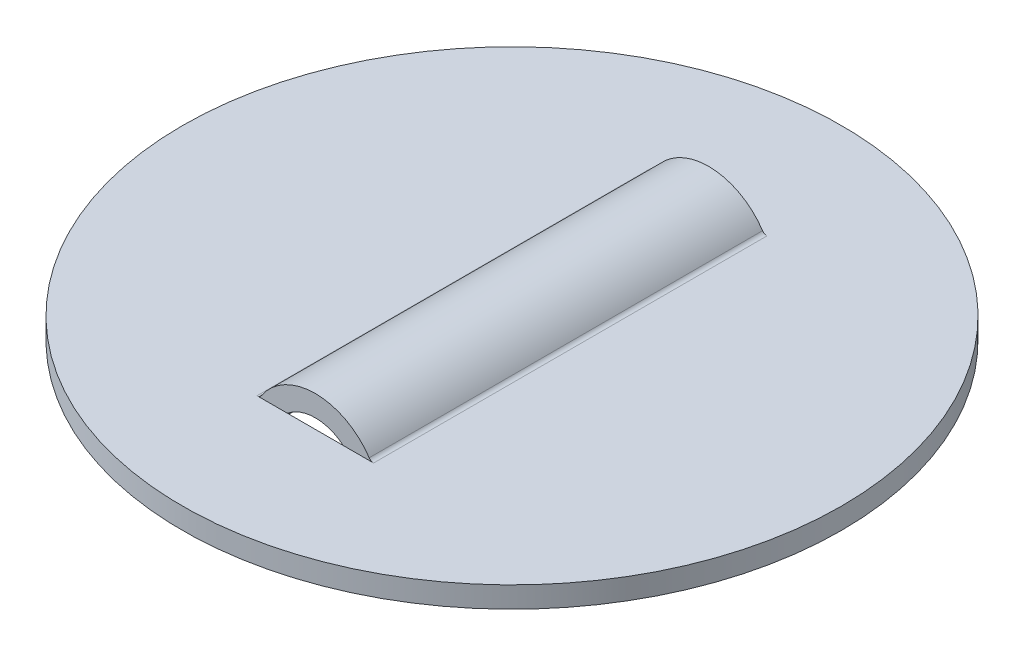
ISO-10303-21;
HEADER;
FILE_DESCRIPTION(('STEP AP214'),'2;1');
FILE_NAME('part.step','',(''),(''),'','','');
FILE_SCHEMA(('AUTOMOTIVE_DESIGN { 1 0 10303 214 1 1 1 1 }'));
ENDSEC;
DATA;
#1=APPLICATION_CONTEXT('core data for automotive mechanical design processes');
#2=APPLICATION_PROTOCOL_DEFINITION('international standard','automotive_design',2000,#1);
#3=PRODUCT_CONTEXT('',#1,'mechanical');
#4=PRODUCT('Part','Part','',(#3));
#5=PRODUCT_RELATED_PRODUCT_CATEGORY('part','',(#4));
#6=PRODUCT_DEFINITION_FORMATION('','',#4);
#7=PRODUCT_DEFINITION_CONTEXT('part definition',#1,'design');
#8=PRODUCT_DEFINITION('design','',#6,#7);
#9=PRODUCT_DEFINITION_SHAPE('','',#8);
#10=(LENGTH_UNIT() NAMED_UNIT(*) SI_UNIT(.MILLI.,.METRE.));
#11=(NAMED_UNIT(*) PLANE_ANGLE_UNIT() SI_UNIT($,.RADIAN.));
#12=(NAMED_UNIT(*) SI_UNIT($,.STERADIAN.) SOLID_ANGLE_UNIT());
#13=UNCERTAINTY_MEASURE_WITH_UNIT(LENGTH_MEASURE(1.E-05),#10,'distance_accuracy_value','');
#14=(GEOMETRIC_REPRESENTATION_CONTEXT(3) GLOBAL_UNCERTAINTY_ASSIGNED_CONTEXT((#13)) GLOBAL_UNIT_ASSIGNED_CONTEXT((#10,
#11,#12)) REPRESENTATION_CONTEXT('',''));
#15=CARTESIAN_POINT('',(0.,0.,0.));
#16=DIRECTION('',(0.,0.,1.));
#17=DIRECTION('',(1.,0.,0.));
#18=AXIS2_PLACEMENT_3D('',#15,#16,#17);
#19=CARTESIAN_POINT('',(0.,-1.6256,18.9484));
#20=DIRECTION('',(0.,0.,-1.));
#21=DIRECTION('',(-1.,0.,0.));
#22=AXIS2_PLACEMENT_3D('',#19,#20,#21);
#23=CYLINDRICAL_SURFACE('',#22,3.1242);
#24=CARTESIAN_POINT('',(0.,-1.6256,0.));
#25=DIRECTION('',(0.,0.,-1.));
#26=DIRECTION('',(-1.,0.,0.));
#27=AXIS2_PLACEMENT_3D('',#24,#25,#26);
#28=CIRCLE('',#27,3.1242);
#29=CARTESIAN_POINT('',(-2.59596220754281,0.112676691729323,0.));
#30=VERTEX_POINT('',#29);
#31=CARTESIAN_POINT('',(2.59596220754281,0.112676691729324,0.));
#32=VERTEX_POINT('',#31);
#33=EDGE_CURVE('E154',#30,#32,#28,.T.);
#34=ORIENTED_EDGE('',*,*,#33,.F.);
#35=DIRECTION('',(0.,0.,-1.));
#36=VECTOR('',#35,1.);
#37=CARTESIAN_POINT('',(-2.59596220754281,0.112676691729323,18.9484));
#38=LINE('',#37,#36);
#39=CARTESIAN_POINT('',(-2.59596220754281,0.112676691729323,18.9484));
#40=VERTEX_POINT('',#39);
#41=EDGE_CURVE('E92',#30,#40,#38,.F.);
#42=ORIENTED_EDGE('',*,*,#41,.T.);
#43=CARTESIAN_POINT('',(0.,-1.6256,18.9484));
#44=DIRECTION('',(0.,0.,-1.));
#45=DIRECTION('',(-1.,0.,0.));
#46=AXIS2_PLACEMENT_3D('',#43,#44,#45);
#47=CIRCLE('',#46,3.1242);
#48=CARTESIAN_POINT('',(2.59596220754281,0.112676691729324,18.9484));
#49=VERTEX_POINT('',#48);
#50=EDGE_CURVE('E164',#40,#49,#47,.T.);
#51=ORIENTED_EDGE('',*,*,#50,.T.);
#52=DIRECTION('',(0.,0.,-1.));
#53=VECTOR('',#52,1.);
#54=CARTESIAN_POINT('',(2.59596220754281,0.112676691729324,18.9484));
#55=LINE('',#54,#53);
#56=EDGE_CURVE('E137',#49,#32,#55,.T.);
#57=ORIENTED_EDGE('',*,*,#56,.T.);
#58=EDGE_LOOP('',(#34,#42,#51,#57));
#59=FACE_BOUND('',#58,.T.);
#60=ADVANCED_FACE('F18',(#59),#23,.T.);
#61=CARTESIAN_POINT('',(-2.80701604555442,0.254,0.));
#62=DIRECTION('',(0.,0.,1.));
#63=DIRECTION('',(1.,0.,0.));
#64=AXIS2_PLACEMENT_3D('',#61,#62,#63);
#65=CYLINDRICAL_SURFACE('',#64,1.27);
#66=CARTESIAN_POINT('',(-2.80701604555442,0.254,0.));
#67=DIRECTION('',(0.,0.,1.));
#68=DIRECTION('',(1.,0.,0.));
#69=AXIS2_PLACEMENT_3D('',#66,#67,#68);
#70=CIRCLE('',#69,1.27);
#71=CARTESIAN_POINT('',(-1.75174685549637,-0.452616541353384,0.));
#72=VERTEX_POINT('',#71);
#73=CARTESIAN_POINT('',(-2.80701604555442,-1.016,0.));
#74=VERTEX_POINT('',#73);
#75=EDGE_CURVE('E148',#72,#74,#70,.F.);
#76=ORIENTED_EDGE('',*,*,#75,.F.);
#77=DIRECTION('',(0.,0.,-1.));
#78=VECTOR('',#77,1.);
#79=CARTESIAN_POINT('',(-1.75174685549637,-0.452616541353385,18.9484));
#80=LINE('',#79,#78);
#81=CARTESIAN_POINT('',(-1.75174685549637,-0.452616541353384,18.9484));
#82=VERTEX_POINT('',#81);
#83=EDGE_CURVE('E128',#72,#82,#80,.F.);
#84=ORIENTED_EDGE('',*,*,#83,.T.);
#85=CARTESIAN_POINT('',(-2.80701604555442,0.254,18.9484));
#86=DIRECTION('',(0.,0.,1.));
#87=DIRECTION('',(1.,0.,0.));
#88=AXIS2_PLACEMENT_3D('',#85,#86,#87);
#89=CIRCLE('',#88,1.27);
#90=CARTESIAN_POINT('',(-2.80701604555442,-1.016,18.9484));
#91=VERTEX_POINT('',#90);
#92=EDGE_CURVE('E89',#82,#91,#89,.F.);
#93=ORIENTED_EDGE('',*,*,#92,.T.);
#94=DIRECTION('',(0.,0.,1.));
#95=VECTOR('',#94,1.);
#96=CARTESIAN_POINT('',(-2.80701604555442,-1.016,18.9484));
#97=LINE('',#96,#95);
#98=EDGE_CURVE('E131',#91,#74,#97,.F.);
#99=ORIENTED_EDGE('',*,*,#98,.T.);
#100=EDGE_LOOP('',(#76,#84,#93,#99));
#101=FACE_BOUND('',#100,.T.);
#102=ADVANCED_FACE('F215',(#101),#65,.T.);
#103=CARTESIAN_POINT('',(-15.875,-1.016,18.9484));
#104=DIRECTION('',(0.,1.,0.));
#105=DIRECTION('',(0.,0.,1.));
#106=AXIS2_PLACEMENT_3D('',#103,#104,#105);
#107=PLANE('',#106);
#108=ORIENTED_EDGE('',*,*,#98,.F.);
#109=DIRECTION('',(1.,0.,0.));
#110=VECTOR('',#109,1.);
#111=CARTESIAN_POINT('',(-2.80701604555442,-1.016,18.9484));
#112=LINE('',#111,#110);
#113=CARTESIAN_POINT('',(2.80701604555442,-1.016,18.9484));
#114=VERTEX_POINT('',#113);
#115=EDGE_CURVE('E123',#91,#114,#112,.T.);
#116=ORIENTED_EDGE('',*,*,#115,.T.);
#117=DIRECTION('',(0.,0.,1.));
#118=VECTOR('',#117,1.);
#119=CARTESIAN_POINT('',(2.80701604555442,-1.016,0.));
#120=LINE('',#119,#118);
#121=CARTESIAN_POINT('',(2.80701604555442,-1.016,0.));
#122=VERTEX_POINT('',#121);
#123=EDGE_CURVE('E129',#122,#114,#120,.T.);
#124=ORIENTED_EDGE('',*,*,#123,.F.);
#125=DIRECTION('',(1.,0.,0.));
#126=VECTOR('',#125,1.);
#127=CARTESIAN_POINT('',(-2.80701604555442,-1.016,0.));
#128=LINE('',#127,#126);
#129=EDGE_CURVE('E147',#74,#122,#128,.T.);
#130=ORIENTED_EDGE('',*,*,#129,.F.);
#131=EDGE_LOOP('',(#108,#116,#124,#130));
#132=FACE_BOUND('',#131,.T.);
#133=CARTESIAN_POINT('',(0.,-1.016,9.4742));
#134=DIRECTION('',(0.,-1.,0.));
#135=DIRECTION('',(1.,0.,0.));
#136=AXIS2_PLACEMENT_3D('',#133,#134,#135);
#137=CIRCLE('',#136,15.875);
#138=CARTESIAN_POINT('',(15.875,-1.016,9.4742));
#139=VERTEX_POINT('',#138);
#140=EDGE_CURVE('E21',#139,#139,#137,.F.);
#141=ORIENTED_EDGE('',*,*,#140,.F.);
#142=EDGE_LOOP('',(#141));
#143=FACE_BOUND('',#142,.T.);
#144=ADVANCED_FACE('F175',(#132,#143),#107,.F.);
#145=CARTESIAN_POINT('',(2.80701604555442,0.254000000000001,0.));
#146=DIRECTION('',(0.,0.,1.));
#147=DIRECTION('',(1.,0.,0.));
#148=AXIS2_PLACEMENT_3D('',#145,#146,#147);
#149=CYLINDRICAL_SURFACE('',#148,1.27);
#150=CARTESIAN_POINT('',(2.80701604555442,0.254000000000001,0.));
#151=DIRECTION('',(0.,0.,1.));
#152=DIRECTION('',(1.,0.,0.));
#153=AXIS2_PLACEMENT_3D('',#150,#151,#152);
#154=CIRCLE('',#153,1.27);
#155=CARTESIAN_POINT('',(1.75174685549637,-0.452616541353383,0.));
#156=VERTEX_POINT('',#155);
#157=EDGE_CURVE('E145',#122,#156,#154,.F.);
#158=ORIENTED_EDGE('',*,*,#157,.F.);
#159=ORIENTED_EDGE('',*,*,#123,.T.);
#160=CARTESIAN_POINT('',(2.80701604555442,0.254000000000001,18.9484));
#161=DIRECTION('',(0.,0.,1.));
#162=DIRECTION('',(1.,0.,0.));
#163=AXIS2_PLACEMENT_3D('',#160,#161,#162);
#164=CIRCLE('',#163,1.27);
#165=CARTESIAN_POINT('',(1.75174685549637,-0.452616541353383,18.9484));
#166=VERTEX_POINT('',#165);
#167=EDGE_CURVE('E168',#114,#166,#164,.F.);
#168=ORIENTED_EDGE('',*,*,#167,.T.);
#169=DIRECTION('',(0.,0.,-1.));
#170=VECTOR('',#169,1.);
#171=CARTESIAN_POINT('',(1.75174685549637,-0.452616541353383,18.9484));
#172=LINE('',#171,#170);
#173=EDGE_CURVE('E125',#166,#156,#172,.T.);
#174=ORIENTED_EDGE('',*,*,#173,.T.);
#175=EDGE_LOOP('',(#158,#159,#168,#174));
#176=FACE_BOUND('',#175,.T.);
#177=ADVANCED_FACE('F181',(#176),#149,.T.);
#178=CARTESIAN_POINT('',(0.,-1.6256,18.9484));
#179=DIRECTION('',(0.,0.,-1.));
#180=DIRECTION('',(-1.,0.,0.));
#181=AXIS2_PLACEMENT_3D('',#178,#179,#180);
#182=CYLINDRICAL_SURFACE('',#181,2.1082);
#183=CARTESIAN_POINT('',(0.,-1.6256,18.9484));
#184=DIRECTION('',(0.,0.,-1.));
#185=DIRECTION('',(-1.,0.,0.));
#186=AXIS2_PLACEMENT_3D('',#183,#184,#185);
#187=CIRCLE('',#186,2.1082);
#188=CARTESIAN_POINT('',(-1.34236056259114,0.,18.9484));
#189=VERTEX_POINT('',#188);
#190=EDGE_CURVE('E80',#189,#82,#187,.F.);
#191=ORIENTED_EDGE('',*,*,#190,.T.);
#192=ORIENTED_EDGE('',*,*,#83,.F.);
#193=CARTESIAN_POINT('',(0.,-1.6256,0.));
#194=DIRECTION('',(0.,0.,-1.));
#195=DIRECTION('',(-1.,0.,0.));
#196=AXIS2_PLACEMENT_3D('',#193,#194,#195);
#197=CIRCLE('',#196,2.1082);
#198=CARTESIAN_POINT('',(-1.34236056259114,0.,0.));
#199=VERTEX_POINT('',#198);
#200=EDGE_CURVE('E151',#199,#72,#197,.F.);
#201=ORIENTED_EDGE('',*,*,#200,.F.);
#202=CARTESIAN_POINT('',(0.,-1.6256,0.));
#203=DIRECTION('',(0.,0.,-1.));
#204=DIRECTION('',(-1.,0.,0.));
#205=AXIS2_PLACEMENT_3D('',#202,#203,#204);
#206=CIRCLE('',#205,2.1082);
#207=CARTESIAN_POINT('',(1.34236056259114,0.,0.));
#208=VERTEX_POINT('',#207);
#209=EDGE_CURVE('E160',#208,#199,#206,.F.);
#210=ORIENTED_EDGE('',*,*,#209,.F.);
#211=CARTESIAN_POINT('',(0.,-1.6256,0.));
#212=DIRECTION('',(0.,0.,-1.));
#213=DIRECTION('',(-1.,0.,0.));
#214=AXIS2_PLACEMENT_3D('',#211,#212,#213);
#215=CIRCLE('',#214,2.1082);
#216=EDGE_CURVE('E35',#156,#208,#215,.F.);
#217=ORIENTED_EDGE('',*,*,#216,.F.);
#218=ORIENTED_EDGE('',*,*,#173,.F.);
#219=CARTESIAN_POINT('',(0.,-1.6256,18.9484));
#220=DIRECTION('',(0.,0.,-1.));
#221=DIRECTION('',(-1.,0.,0.));
#222=AXIS2_PLACEMENT_3D('',#219,#220,#221);
#223=CIRCLE('',#222,2.1082);
#224=CARTESIAN_POINT('',(1.34236056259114,0.,18.9484));
#225=VERTEX_POINT('',#224);
#226=EDGE_CURVE('E96',#166,#225,#223,.F.);
#227=ORIENTED_EDGE('',*,*,#226,.T.);
#228=CARTESIAN_POINT('',(0.,-1.6256,18.9484));
#229=DIRECTION('',(0.,0.,-1.));
#230=DIRECTION('',(-1.,0.,0.));
#231=AXIS2_PLACEMENT_3D('',#228,#229,#230);
#232=CIRCLE('',#231,2.1082);
#233=EDGE_CURVE('E94',#225,#189,#232,.F.);
#234=ORIENTED_EDGE('',*,*,#233,.T.);
#235=EDGE_LOOP('',(#191,#192,#201,#210,#217,#218,#227,#234));
#236=FACE_BOUND('',#235,.T.);
#237=ADVANCED_FACE('F95',(#236),#182,.F.);
#238=CARTESIAN_POINT('',(0.,0.,9.4742));
#239=DIRECTION('',(0.,-1.,0.));
#240=DIRECTION('',(1.,0.,0.));
#241=AXIS2_PLACEMENT_3D('',#238,#239,#240);
#242=CYLINDRICAL_SURFACE('',#241,15.875);
#243=ORIENTED_EDGE('',*,*,#140,.T.);
#244=EDGE_LOOP('',(#243));
#245=FACE_BOUND('',#244,.T.);
#246=CARTESIAN_POINT('',(0.,0.,9.4742));
#247=DIRECTION('',(0.,-1.,0.));
#248=DIRECTION('',(1.,0.,0.));
#249=AXIS2_PLACEMENT_3D('',#246,#247,#248);
#250=CIRCLE('',#249,15.875);
#251=CARTESIAN_POINT('',(15.875,0.,9.4742));
#252=VERTEX_POINT('',#251);
#253=EDGE_CURVE('E141',#252,#252,#250,.T.);
#254=ORIENTED_EDGE('',*,*,#253,.T.);
#255=EDGE_LOOP('',(#254));
#256=FACE_BOUND('',#255,.T.);
#257=ADVANCED_FACE('F236',(#245,#256),#242,.T.);
#258=CARTESIAN_POINT('',(-2.80701604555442,0.254,18.9484));
#259=DIRECTION('',(0.,0.,-1.));
#260=DIRECTION('',(-1.,0.,0.));
#261=AXIS2_PLACEMENT_3D('',#258,#259,#260);
#262=CYLINDRICAL_SURFACE('',#261,0.254);
#263=CARTESIAN_POINT('',(-2.80701604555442,0.254,18.9484));
#264=DIRECTION('',(0.,0.,-1.));
#265=DIRECTION('',(-1.,0.,0.));
#266=AXIS2_PLACEMENT_3D('',#263,#264,#265);
#267=CIRCLE('',#266,0.254);
#268=CARTESIAN_POINT('',(-2.80701604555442,0.,18.9484));
#269=VERTEX_POINT('',#268);
#270=EDGE_CURVE('E101',#269,#40,#267,.F.);
#271=ORIENTED_EDGE('',*,*,#270,.T.);
#272=ORIENTED_EDGE('',*,*,#41,.F.);
#273=CARTESIAN_POINT('',(-2.80701604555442,0.254,0.));
#274=DIRECTION('',(0.,0.,-1.));
#275=DIRECTION('',(-1.,0.,0.));
#276=AXIS2_PLACEMENT_3D('',#273,#274,#275);
#277=CIRCLE('',#276,0.254);
#278=CARTESIAN_POINT('',(-2.80701604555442,0.,0.));
#279=VERTEX_POINT('',#278);
#280=EDGE_CURVE('E157',#279,#30,#277,.F.);
#281=ORIENTED_EDGE('',*,*,#280,.F.);
#282=DIRECTION('',(0.,0.,1.));
#283=VECTOR('',#282,1.);
#284=CARTESIAN_POINT('',(-2.80701604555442,0.,18.9484));
#285=LINE('',#284,#283);
#286=EDGE_CURVE('E118',#279,#269,#285,.T.);
#287=ORIENTED_EDGE('',*,*,#286,.T.);
#288=EDGE_LOOP('',(#271,#272,#281,#287));
#289=FACE_BOUND('',#288,.T.);
#290=ADVANCED_FACE('F193',(#289),#262,.F.);
#291=CARTESIAN_POINT('',(-2.80701604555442,0.254,18.9484));
#292=DIRECTION('',(0.,0.,1.));
#293=DIRECTION('',(1.,0.,0.));
#294=AXIS2_PLACEMENT_3D('',#291,#292,#293);
#295=PLANE('',#294);
#296=ORIENTED_EDGE('',*,*,#167,.F.);
#297=ORIENTED_EDGE('',*,*,#115,.F.);
#298=ORIENTED_EDGE('',*,*,#92,.F.);
#299=ORIENTED_EDGE('',*,*,#190,.F.);
#300=DIRECTION('',(1.,0.,0.));
#301=VECTOR('',#300,1.);
#302=CARTESIAN_POINT('',(2.80701604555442,0.,18.9484));
#303=LINE('',#302,#301);
#304=EDGE_CURVE('E86',#189,#225,#303,.T.);
#305=ORIENTED_EDGE('',*,*,#304,.T.);
#306=ORIENTED_EDGE('',*,*,#226,.F.);
#307=EDGE_LOOP('',(#296,#297,#298,#299,#305,#306));
#308=FACE_BOUND('',#307,.T.);
#309=ADVANCED_FACE('F83',(#308),#295,.F.);
#310=CARTESIAN_POINT('',(-2.80701604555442,0.254,18.9484));
#311=DIRECTION('',(0.,0.,-1.));
#312=DIRECTION('',(-1.,0.,0.));
#313=AXIS2_PLACEMENT_3D('',#310,#311,#312);
#314=PLANE('',#313);
#315=CARTESIAN_POINT('',(2.80701604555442,0.254000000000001,18.9484));
#316=DIRECTION('',(0.,0.,-1.));
#317=DIRECTION('',(-1.,0.,0.));
#318=AXIS2_PLACEMENT_3D('',#315,#316,#317);
#319=CIRCLE('',#318,0.254);
#320=CARTESIAN_POINT('',(2.80701604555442,0.,18.9484));
#321=VERTEX_POINT('',#320);
#322=EDGE_CURVE('E140',#321,#49,#319,.T.);
#323=ORIENTED_EDGE('',*,*,#322,.T.);
#324=ORIENTED_EDGE('',*,*,#50,.F.);
#325=ORIENTED_EDGE('',*,*,#270,.F.);
#326=DIRECTION('',(1.,0.,0.));
#327=VECTOR('',#326,1.);
#328=CARTESIAN_POINT('',(2.80701604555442,0.,18.9484));
#329=LINE('',#328,#327);
#330=EDGE_CURVE('E109',#269,#189,#329,.T.);
#331=ORIENTED_EDGE('',*,*,#330,.T.);
#332=ORIENTED_EDGE('',*,*,#233,.F.);
#333=DIRECTION('',(1.,0.,0.));
#334=VECTOR('',#333,1.);
#335=CARTESIAN_POINT('',(2.80701604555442,0.,18.9484));
#336=LINE('',#335,#334);
#337=EDGE_CURVE('E112',#225,#321,#336,.T.);
#338=ORIENTED_EDGE('',*,*,#337,.T.);
#339=EDGE_LOOP('',(#323,#324,#325,#331,#332,#338));
#340=FACE_BOUND('',#339,.T.);
#341=ADVANCED_FACE('F115',(#340),#314,.F.);
#342=CARTESIAN_POINT('',(2.80701604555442,0.254000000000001,18.9484));
#343=DIRECTION('',(0.,0.,-1.));
#344=DIRECTION('',(-1.,0.,0.));
#345=AXIS2_PLACEMENT_3D('',#342,#343,#344);
#346=CYLINDRICAL_SURFACE('',#345,0.254);
#347=ORIENTED_EDGE('',*,*,#322,.F.);
#348=DIRECTION('',(0.,0.,1.));
#349=VECTOR('',#348,1.);
#350=CARTESIAN_POINT('',(2.80701604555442,0.,18.9484));
#351=LINE('',#350,#349);
#352=CARTESIAN_POINT('',(2.80701604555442,0.,0.));
#353=VERTEX_POINT('',#352);
#354=EDGE_CURVE('E205',#321,#353,#351,.F.);
#355=ORIENTED_EDGE('',*,*,#354,.T.);
#356=CARTESIAN_POINT('',(2.80701604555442,0.254000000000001,0.));
#357=DIRECTION('',(0.,0.,-1.));
#358=DIRECTION('',(-1.,0.,0.));
#359=AXIS2_PLACEMENT_3D('',#356,#357,#358);
#360=CIRCLE('',#359,0.254);
#361=EDGE_CURVE('E139',#32,#353,#360,.F.);
#362=ORIENTED_EDGE('',*,*,#361,.F.);
#363=ORIENTED_EDGE('',*,*,#56,.F.);
#364=EDGE_LOOP('',(#347,#355,#362,#363));
#365=FACE_BOUND('',#364,.T.);
#366=ADVANCED_FACE('F210',(#365),#346,.F.);
#367=CARTESIAN_POINT('',(-2.80701604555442,0.254,0.));
#368=DIRECTION('',(0.,0.,-1.));
#369=DIRECTION('',(-1.,0.,0.));
#370=AXIS2_PLACEMENT_3D('',#367,#368,#369);
#371=PLANE('',#370);
#372=ORIENTED_EDGE('',*,*,#280,.T.);
#373=ORIENTED_EDGE('',*,*,#33,.T.);
#374=ORIENTED_EDGE('',*,*,#361,.T.);
#375=DIRECTION('',(1.,0.,0.));
#376=VECTOR('',#375,1.);
#377=CARTESIAN_POINT('',(2.80701604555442,0.,0.));
#378=LINE('',#377,#376);
#379=EDGE_CURVE('E27',#353,#208,#378,.F.);
#380=ORIENTED_EDGE('',*,*,#379,.T.);
#381=ORIENTED_EDGE('',*,*,#209,.T.);
#382=DIRECTION('',(1.,0.,0.));
#383=VECTOR('',#382,1.);
#384=CARTESIAN_POINT('',(2.80701604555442,0.,0.));
#385=LINE('',#384,#383);
#386=EDGE_CURVE('E120',#199,#279,#385,.F.);
#387=ORIENTED_EDGE('',*,*,#386,.T.);
#388=EDGE_LOOP('',(#372,#373,#374,#380,#381,#387));
#389=FACE_BOUND('',#388,.T.);
#390=ADVANCED_FACE('F200',(#389),#371,.T.);
#391=CARTESIAN_POINT('',(-2.80701604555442,0.254,0.));
#392=DIRECTION('',(0.,0.,1.));
#393=DIRECTION('',(1.,0.,0.));
#394=AXIS2_PLACEMENT_3D('',#391,#392,#393);
#395=PLANE('',#394);
#396=ORIENTED_EDGE('',*,*,#157,.T.);
#397=ORIENTED_EDGE('',*,*,#216,.T.);
#398=DIRECTION('',(1.,0.,0.));
#399=VECTOR('',#398,1.);
#400=CARTESIAN_POINT('',(2.80701604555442,0.,0.));
#401=LINE('',#400,#399);
#402=EDGE_CURVE('E11',#208,#199,#401,.F.);
#403=ORIENTED_EDGE('',*,*,#402,.T.);
#404=ORIENTED_EDGE('',*,*,#200,.T.);
#405=ORIENTED_EDGE('',*,*,#75,.T.);
#406=ORIENTED_EDGE('',*,*,#129,.T.);
#407=EDGE_LOOP('',(#396,#397,#403,#404,#405,#406));
#408=FACE_BOUND('',#407,.T.);
#409=ADVANCED_FACE('F185',(#408),#395,.T.);
#410=CARTESIAN_POINT('',(2.80701604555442,0.,18.9484));
#411=DIRECTION('',(0.,-1.,0.));
#412=DIRECTION('',(1.,0.,0.));
#413=AXIS2_PLACEMENT_3D('',#410,#411,#412);
#414=PLANE('',#413);
#415=ORIENTED_EDGE('',*,*,#379,.F.);
#416=ORIENTED_EDGE('',*,*,#354,.F.);
#417=ORIENTED_EDGE('',*,*,#337,.F.);
#418=ORIENTED_EDGE('',*,*,#304,.F.);
#419=ORIENTED_EDGE('',*,*,#330,.F.);
#420=ORIENTED_EDGE('',*,*,#286,.F.);
#421=ORIENTED_EDGE('',*,*,#386,.F.);
#422=ORIENTED_EDGE('',*,*,#402,.F.);
#423=EDGE_LOOP('',(#415,#416,#417,#418,#419,#420,#421,#422));
#424=FACE_BOUND('',#423,.T.);
#425=ORIENTED_EDGE('',*,*,#253,.F.);
#426=EDGE_LOOP('',(#425));
#427=FACE_BOUND('',#426,.T.);
#428=ADVANCED_FACE('F106',(#424,#427),#414,.F.);
#429=CLOSED_SHELL('',(#60,#102,#144,#177,#237,#257,#290,#309,#341,#366,#390,#409,#428));
#430=MANIFOLD_SOLID_BREP('B1',#429);
#431=ADVANCED_BREP_SHAPE_REPRESENTATION('',(#18,#430),#14);
#432=SHAPE_DEFINITION_REPRESENTATION(#9,#431);
ENDSEC;
END-ISO-10303-21;
